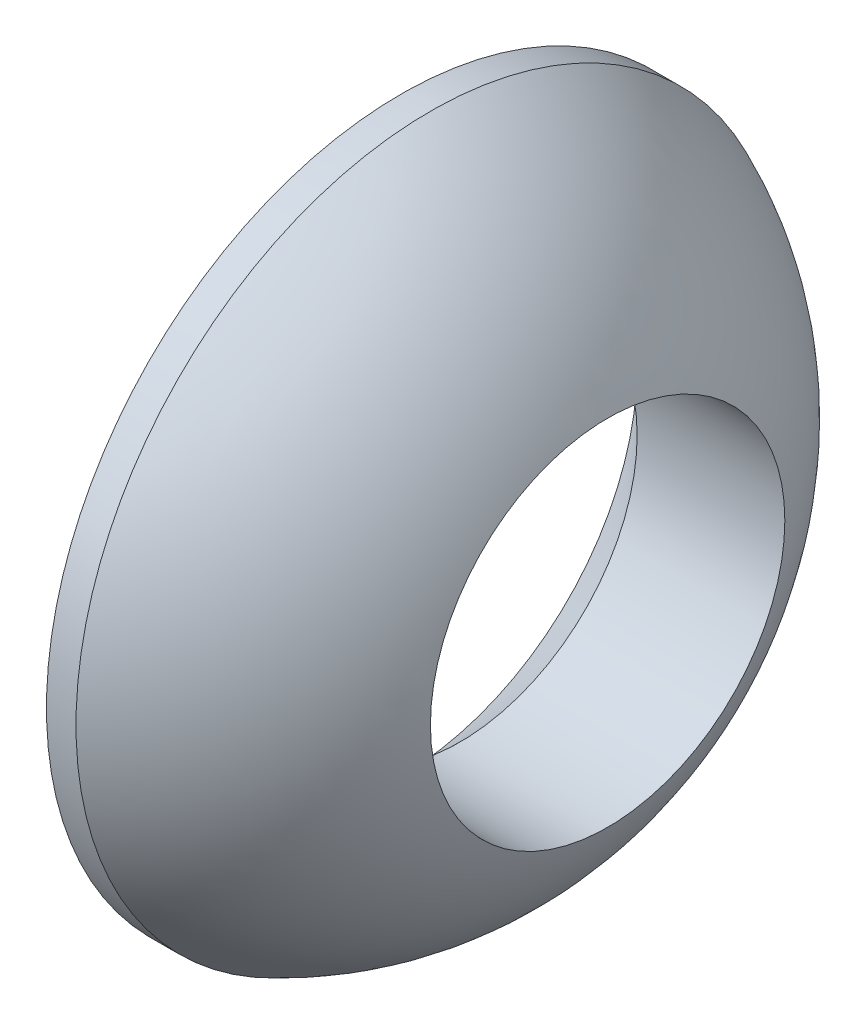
from build123d import *

# Parameters (mm, degrees)
ESQUISSE2_R             = 3
ENL_V_MAT_EXTRU_3_DEPTH = 10
CHANFREIN1_SIZE         = 1


with BuildPart() as part:
    # Esquisse1 → Base-R_volution (revolve)
    with BuildSketch(Plane.XY, mode=Mode.PRIVATE) as base_r_volution_sk:
        with BuildLine():
            Line((0, 0), (0, -6))
            Line((0, -6), (0.5, -6))
            ThreePointArc((0.5, -6), (2.294294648, -4.794294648), (3.5, -3))
            Line((3.5, -3), (3.5, 0))
            Line((3.5, 0), (0, 0))
        make_face()
    revolve(base_r_volution_sk.sketch.rotate(Axis((3.5, 0, 0), (-1, 0, 0)), 270), axis=Axis((3.5, 0, 0), (-1, 0, 0)))

    # Esquisse2 → Enl_v. mat.-Extru.3 (cut)
    with BuildSketch(Plane(origin=(0, 0, 0), x_dir=(0, 0, -1), z_dir=(1, 0, 0))):
        Circle(ESQUISSE2_R)
    extrude(amount=ENL_V_MAT_EXTRU_3_DEPTH, mode=Mode.SUBTRACT)

    # Chanfrein1
    chanfrein1_edges = [part.edges().sort_by_distance(p)[0] for p in [
        (0, 0, 3),
    ]]
    chamfer(chanfrein1_edges, length=CHANFREIN1_SIZE)


solid = part.part
